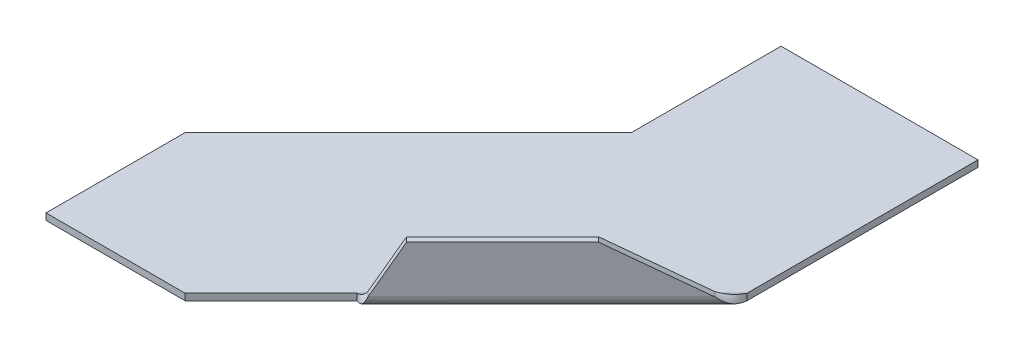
ISO-10303-21;
HEADER;
FILE_DESCRIPTION(('STEP AP214'),'2;1');
FILE_NAME('part.step','',(''),(''),'','','');
FILE_SCHEMA(('AUTOMOTIVE_DESIGN { 1 0 10303 214 1 1 1 1 }'));
ENDSEC;
DATA;
#1=APPLICATION_CONTEXT('core data for automotive mechanical design processes');
#2=APPLICATION_PROTOCOL_DEFINITION('international standard','automotive_design',2000,#1);
#3=PRODUCT_CONTEXT('',#1,'mechanical');
#4=PRODUCT('Part','Part','',(#3));
#5=PRODUCT_RELATED_PRODUCT_CATEGORY('part','',(#4));
#6=PRODUCT_DEFINITION_FORMATION('','',#4);
#7=PRODUCT_DEFINITION_CONTEXT('part definition',#1,'design');
#8=PRODUCT_DEFINITION('design','',#6,#7);
#9=PRODUCT_DEFINITION_SHAPE('','',#8);
#10=(LENGTH_UNIT() NAMED_UNIT(*) SI_UNIT(.MILLI.,.METRE.));
#11=(NAMED_UNIT(*) PLANE_ANGLE_UNIT() SI_UNIT($,.RADIAN.));
#12=(NAMED_UNIT(*) SI_UNIT($,.STERADIAN.) SOLID_ANGLE_UNIT());
#13=UNCERTAINTY_MEASURE_WITH_UNIT(LENGTH_MEASURE(1.E-05),#10,'distance_accuracy_value','');
#14=(GEOMETRIC_REPRESENTATION_CONTEXT(3) GLOBAL_UNCERTAINTY_ASSIGNED_CONTEXT((#13)) GLOBAL_UNIT_ASSIGNED_CONTEXT((#10,
#11,#12)) REPRESENTATION_CONTEXT('',''));
#15=CARTESIAN_POINT('',(0.,0.,0.));
#16=DIRECTION('',(0.,0.,1.));
#17=DIRECTION('',(1.,0.,0.));
#18=AXIS2_PLACEMENT_3D('',#15,#16,#17);
#19=CARTESIAN_POINT('',(94.293250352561,0.,94.29325035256));
#20=DIRECTION('',(-0.707106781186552,0.,-0.707106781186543));
#21=DIRECTION('',(-0.707106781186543,0.,0.707106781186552));
#22=AXIS2_PLACEMENT_3D('',#19,#20,#21);
#23=PLANE('',#22);
#24=DIRECTION('',(-0.707106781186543,0.,0.707106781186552));
#25=VECTOR('',#24,1.);
#26=CARTESIAN_POINT('',(94.2932503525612,40.0000000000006,94.2932503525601));
#27=LINE('',#26,#25);
#28=CARTESIAN_POINT('',(-50.2325178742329,40.0000000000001,238.819018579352));
#29=VERTEX_POINT('',#28);
#30=CARTESIAN_POINT('',(-123.357250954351,39.9999999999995,311.943751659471));
#31=VERTEX_POINT('',#30);
#32=EDGE_CURVE('E624',#29,#31,#27,.T.);
#33=ORIENTED_EDGE('',*,*,#32,.T.);
#34=DIRECTION('',(-0.353553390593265,-0.866025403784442,0.353553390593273));
#35=VECTOR('',#34,1.);
#36=CARTESIAN_POINT('',(-123.357250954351,39.9999999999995,311.943751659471));
#37=LINE('',#36,#35);
#38=CARTESIAN_POINT('',(-138.095014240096,3.90000000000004,326.681514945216));
#39=VERTEX_POINT('',#38);
#40=EDGE_CURVE('E264',#31,#39,#37,.T.);
#41=ORIENTED_EDGE('',*,*,#40,.T.);
#42=DIRECTION('',(-0.707106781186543,0.,0.707106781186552));
#43=VECTOR('',#42,1.);
#44=CARTESIAN_POINT('',(-207.706749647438,3.90000000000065,396.293250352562));
#45=LINE('',#44,#43);
#46=CARTESIAN_POINT('',(-6.01922801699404,3.9,194.605728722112));
#47=VERTEX_POINT('',#46);
#48=EDGE_CURVE('E192',#47,#39,#45,.T.);
#49=ORIENTED_EDGE('',*,*,#48,.F.);
#50=DIRECTION('',(-0.612372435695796,0.49999999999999,0.612372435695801));
#51=VECTOR('',#50,1.);
#52=CARTESIAN_POINT('',(6.29325035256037,-6.15309649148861,182.293250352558));
#53=LINE('',#52,#51);
#54=EDGE_CURVE('E271',#47,#29,#53,.T.);
#55=ORIENTED_EDGE('',*,*,#54,.T.);
#56=EDGE_LOOP('',(#33,#41,#49,#55));
#57=FACE_BOUND('',#56,.T.);
#58=ADVANCED_FACE('F74',(#57),#23,.F.);
#59=CARTESIAN_POINT('',(90.7577164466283,1.11022302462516E-13,90.7577164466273));
#60=DIRECTION('',(-0.707106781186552,0.,-0.707106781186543));
#61=DIRECTION('',(-0.707106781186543,0.,0.707106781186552));
#62=AXIS2_PLACEMENT_3D('',#59,#60,#61);
#63=PLANE('',#62);
#64=DIRECTION('',(-0.353553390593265,-0.866025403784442,0.353553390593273));
#65=VECTOR('',#64,1.);
#66=CARTESIAN_POINT('',(-126.892784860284,39.9999999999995,308.408217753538));
#67=LINE('',#66,#65);
#68=CARTESIAN_POINT('',(-126.892784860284,39.9999999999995,308.408217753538));
#69=VERTEX_POINT('',#68);
#70=CARTESIAN_POINT('',(-141.630548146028,3.89999999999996,323.145981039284));
#71=VERTEX_POINT('',#70);
#72=EDGE_CURVE('E99',#69,#71,#67,.T.);
#73=ORIENTED_EDGE('',*,*,#72,.F.);
#74=DIRECTION('',(0.707106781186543,0.,-0.707106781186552));
#75=VECTOR('',#74,1.);
#76=CARTESIAN_POINT('',(-211.24228355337,40.0000000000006,392.75771644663));
#77=LINE('',#76,#75);
#78=CARTESIAN_POINT('',(-53.7680517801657,40.0000000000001,235.283484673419));
#79=VERTEX_POINT('',#78);
#80=EDGE_CURVE('E622',#79,#69,#77,.F.);
#81=ORIENTED_EDGE('',*,*,#80,.F.);
#82=DIRECTION('',(-0.612372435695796,0.49999999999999,0.612372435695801));
#83=VECTOR('',#82,1.);
#84=CARTESIAN_POINT('',(2.75771644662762,-6.15309649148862,178.757716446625));
#85=LINE('',#84,#83);
#86=CARTESIAN_POINT('',(-9.55476192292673,3.89999999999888,191.07019481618));
#87=VERTEX_POINT('',#86);
#88=EDGE_CURVE('E91',#87,#79,#85,.T.);
#89=ORIENTED_EDGE('',*,*,#88,.F.);
#90=DIRECTION('',(0.707106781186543,0.,-0.707106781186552));
#91=VECTOR('',#90,1.);
#92=CARTESIAN_POINT('',(-211.242283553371,3.90000000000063,392.75771644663));
#93=LINE('',#92,#91);
#94=EDGE_CURVE('E84',#71,#87,#93,.T.);
#95=ORIENTED_EDGE('',*,*,#94,.F.);
#96=EDGE_LOOP('',(#73,#81,#89,#95));
#97=FACE_BOUND('',#96,.T.);
#98=ADVANCED_FACE('F248',(#97),#63,.T.);
#99=CARTESIAN_POINT('',(-207.706749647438,40.0000000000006,396.293250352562));
#100=DIRECTION('',(0.,-1.,0.));
#101=DIRECTION('',(1.,0.,0.));
#102=AXIS2_PLACEMENT_3D('',#99,#100,#101);
#103=PLANE('',#102);
#104=ORIENTED_EDGE('',*,*,#80,.T.);
#105=DIRECTION('',(-0.707106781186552,0.,-0.707106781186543));
#106=VECTOR('',#105,1.);
#107=CARTESIAN_POINT('',(-123.357250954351,39.9999999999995,311.943751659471));
#108=LINE('',#107,#106);
#109=EDGE_CURVE('E274',#31,#69,#108,.T.);
#110=ORIENTED_EDGE('',*,*,#109,.F.);
#111=ORIENTED_EDGE('',*,*,#32,.F.);
#112=DIRECTION('',(-0.707106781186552,0.,-0.707106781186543));
#113=VECTOR('',#112,1.);
#114=CARTESIAN_POINT('',(-50.2325178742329,40.0000000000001,238.819018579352));
#115=LINE('',#114,#113);
#116=EDGE_CURVE('E270',#29,#79,#115,.T.);
#117=ORIENTED_EDGE('',*,*,#116,.T.);
#118=EDGE_LOOP('',(#104,#110,#111,#117));
#119=FACE_BOUND('',#118,.T.);
#120=ADVANCED_FACE('F252',(#119),#103,.F.);
#121=CARTESIAN_POINT('',(6.29325035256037,-6.15309649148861,182.293250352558));
#122=DIRECTION('',(-0.353553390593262,-0.866025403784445,0.353553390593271));
#123=DIRECTION('',(-0.612372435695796,0.49999999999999,0.612372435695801));
#124=AXIS2_PLACEMENT_3D('',#121,#122,#123);
#125=PLANE('',#124);
#126=CARTESIAN_POINT('',(-9.55476192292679,3.9,191.07019481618));
#127=CARTESIAN_POINT('',(-6.01922801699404,3.9,194.605728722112));
#128=B_SPLINE_CURVE_WITH_KNOTS('',1,(#126,#127),.UNSPECIFIED.,.F.,.F.,(2,2),(0.,1.),.UNSPECIFIED.);
#129=EDGE_CURVE('E13',#87,#47,#128,.T.);
#130=ORIENTED_EDGE('',*,*,#129,.F.);
#131=ORIENTED_EDGE('',*,*,#88,.T.);
#132=ORIENTED_EDGE('',*,*,#116,.F.);
#133=ORIENTED_EDGE('',*,*,#54,.F.);
#134=EDGE_LOOP('',(#130,#131,#132,#133));
#135=FACE_BOUND('',#134,.T.);
#136=ADVANCED_FACE('F76',(#135),#125,.F.);
#137=CARTESIAN_POINT('',(-123.357250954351,39.9999999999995,311.943751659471));
#138=DIRECTION('',(0.612372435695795,-0.499999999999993,-0.6123724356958));
#139=DIRECTION('',(-0.353553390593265,-0.866025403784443,0.353553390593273));
#140=AXIS2_PLACEMENT_3D('',#137,#138,#139);
#141=PLANE('',#140);
#142=CARTESIAN_POINT('',(-138.095014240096,3.9,326.681514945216));
#143=CARTESIAN_POINT('',(-141.630548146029,3.9,323.145981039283));
#144=B_SPLINE_CURVE_WITH_KNOTS('',1,(#142,#143),.UNSPECIFIED.,.F.,.F.,(2,2),(0.,1.),.UNSPECIFIED.);
#145=EDGE_CURVE('E300',#39,#71,#144,.T.);
#146=ORIENTED_EDGE('',*,*,#145,.F.);
#147=ORIENTED_EDGE('',*,*,#40,.F.);
#148=ORIENTED_EDGE('',*,*,#109,.T.);
#149=ORIENTED_EDGE('',*,*,#72,.T.);
#150=EDGE_LOOP('',(#146,#147,#148,#149));
#151=FACE_BOUND('',#150,.T.);
#152=ADVANCED_FACE('F255',(#151),#141,.F.);
#153=CARTESIAN_POINT('',(-150.,-5.,0.));
#154=DIRECTION('',(0.,0.,-1.));
#155=DIRECTION('',(-1.,0.,0.));
#156=AXIS2_PLACEMENT_3D('',#153,#154,#155);
#157=PLANE('',#156);
#158=DIRECTION('',(-1.,0.,0.));
#159=VECTOR('',#158,1.);
#160=CARTESIAN_POINT('',(-150.,0.,0.));
#161=LINE('',#160,#159);
#162=CARTESIAN_POINT('',(0.,0.,0.));
#163=VERTEX_POINT('',#162);
#164=CARTESIAN_POINT('',(-150.,0.,0.));
#165=VERTEX_POINT('',#164);
#166=EDGE_CURVE('E327',#163,#165,#161,.T.);
#167=ORIENTED_EDGE('',*,*,#166,.F.);
#168=DIRECTION('',(0.,1.,0.));
#169=VECTOR('',#168,1.);
#170=CARTESIAN_POINT('',(0.,-5.,0.));
#171=LINE('',#170,#169);
#172=CARTESIAN_POINT('',(0.,-5.,0.));
#173=VERTEX_POINT('',#172);
#174=EDGE_CURVE('E222',#173,#163,#171,.T.);
#175=ORIENTED_EDGE('',*,*,#174,.F.);
#176=DIRECTION('',(-1.,0.,0.));
#177=VECTOR('',#176,1.);
#178=CARTESIAN_POINT('',(-150.,-5.,0.));
#179=LINE('',#178,#177);
#180=CARTESIAN_POINT('',(-150.,-5.,0.));
#181=VERTEX_POINT('',#180);
#182=EDGE_CURVE('E214',#173,#181,#179,.T.);
#183=ORIENTED_EDGE('',*,*,#182,.T.);
#184=DIRECTION('',(0.,1.,0.));
#185=VECTOR('',#184,1.);
#186=CARTESIAN_POINT('',(-150.,-5.,0.));
#187=LINE('',#186,#185);
#188=EDGE_CURVE('E348',#181,#165,#187,.T.);
#189=ORIENTED_EDGE('',*,*,#188,.T.);
#190=EDGE_LOOP('',(#167,#175,#183,#189));
#191=FACE_BOUND('',#190,.T.);
#192=ADVANCED_FACE('F258',(#191),#157,.T.);
#193=CARTESIAN_POINT('',(-150.,-5.,113.999999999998));
#194=DIRECTION('',(-1.,0.,0.));
#195=DIRECTION('',(0.,0.,1.));
#196=AXIS2_PLACEMENT_3D('',#193,#194,#195);
#197=PLANE('',#196);
#198=DIRECTION('',(0.,0.,1.));
#199=VECTOR('',#198,1.);
#200=CARTESIAN_POINT('',(-150.,0.,113.999999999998));
#201=LINE('',#200,#199);
#202=CARTESIAN_POINT('',(-150.,0.,113.999999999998));
#203=VERTEX_POINT('',#202);
#204=EDGE_CURVE('E324',#165,#203,#201,.T.);
#205=ORIENTED_EDGE('',*,*,#204,.F.);
#206=ORIENTED_EDGE('',*,*,#188,.F.);
#207=DIRECTION('',(0.,0.,1.));
#208=VECTOR('',#207,1.);
#209=CARTESIAN_POINT('',(-150.,-5.,113.999999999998));
#210=LINE('',#209,#208);
#211=CARTESIAN_POINT('',(-150.,-5.,113.999999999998));
#212=VERTEX_POINT('',#211);
#213=EDGE_CURVE('E345',#181,#212,#210,.T.);
#214=ORIENTED_EDGE('',*,*,#213,.T.);
#215=DIRECTION('',(0.,1.,0.));
#216=VECTOR('',#215,1.);
#217=CARTESIAN_POINT('',(-150.,-5.,113.999999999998));
#218=LINE('',#217,#216);
#219=EDGE_CURVE('E343',#212,#203,#218,.T.);
#220=ORIENTED_EDGE('',*,*,#219,.T.);
#221=EDGE_LOOP('',(#205,#206,#214,#220));
#222=FACE_BOUND('',#221,.T.);
#223=ADVANCED_FACE('F383',(#222),#197,.T.);
#224=CARTESIAN_POINT('',(-150.,-5.,113.999999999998));
#225=DIRECTION('',(-0.707106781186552,0.,-0.707106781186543));
#226=DIRECTION('',(-0.707106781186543,0.,0.707106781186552));
#227=AXIS2_PLACEMENT_3D('',#224,#225,#226);
#228=PLANE('',#227);
#229=DIRECTION('',(-0.707106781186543,0.,0.707106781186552));
#230=VECTOR('',#229,1.);
#231=CARTESIAN_POINT('',(-150.,0.,113.999999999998));
#232=LINE('',#231,#230);
#233=CARTESIAN_POINT('',(-320.,0.,284.));
#234=VERTEX_POINT('',#233);
#235=EDGE_CURVE('E321',#203,#234,#232,.T.);
#236=ORIENTED_EDGE('',*,*,#235,.F.);
#237=ORIENTED_EDGE('',*,*,#219,.F.);
#238=DIRECTION('',(-0.707106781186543,0.,0.707106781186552));
#239=VECTOR('',#238,1.);
#240=CARTESIAN_POINT('',(-150.,-5.,113.999999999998));
#241=LINE('',#240,#239);
#242=CARTESIAN_POINT('',(-320.,-5.,284.));
#243=VERTEX_POINT('',#242);
#244=EDGE_CURVE('E340',#212,#243,#241,.T.);
#245=ORIENTED_EDGE('',*,*,#244,.T.);
#246=DIRECTION('',(0.,1.,0.));
#247=VECTOR('',#246,1.);
#248=CARTESIAN_POINT('',(-320.,-5.,284.));
#249=LINE('',#248,#247);
#250=EDGE_CURVE('E338',#243,#234,#249,.T.);
#251=ORIENTED_EDGE('',*,*,#250,.T.);
#252=EDGE_LOOP('',(#236,#237,#245,#251));
#253=FACE_BOUND('',#252,.T.);
#254=ADVANCED_FACE('F379',(#253),#228,.T.);
#255=CARTESIAN_POINT('',(-320.,-5.,390.));
#256=DIRECTION('',(-1.,0.,0.));
#257=DIRECTION('',(0.,0.,1.));
#258=AXIS2_PLACEMENT_3D('',#255,#256,#257);
#259=PLANE('',#258);
#260=DIRECTION('',(0.,0.,1.));
#261=VECTOR('',#260,1.);
#262=CARTESIAN_POINT('',(-320.,0.,390.));
#263=LINE('',#262,#261);
#264=CARTESIAN_POINT('',(-320.,0.,390.));
#265=VERTEX_POINT('',#264);
#266=EDGE_CURVE('E318',#234,#265,#263,.T.);
#267=ORIENTED_EDGE('',*,*,#266,.F.);
#268=ORIENTED_EDGE('',*,*,#250,.F.);
#269=DIRECTION('',(0.,0.,1.));
#270=VECTOR('',#269,1.);
#271=CARTESIAN_POINT('',(-320.,-5.,390.));
#272=LINE('',#271,#270);
#273=CARTESIAN_POINT('',(-320.,-5.,390.));
#274=VERTEX_POINT('',#273);
#275=EDGE_CURVE('E335',#243,#274,#272,.T.);
#276=ORIENTED_EDGE('',*,*,#275,.T.);
#277=DIRECTION('',(0.,1.,0.));
#278=VECTOR('',#277,1.);
#279=CARTESIAN_POINT('',(-320.,-5.,390.));
#280=LINE('',#279,#278);
#281=EDGE_CURVE('E333',#274,#265,#280,.T.);
#282=ORIENTED_EDGE('',*,*,#281,.T.);
#283=EDGE_LOOP('',(#267,#268,#276,#282));
#284=FACE_BOUND('',#283,.T.);
#285=ADVANCED_FACE('F375',(#284),#259,.T.);
#286=CARTESIAN_POINT('',(-214.,-5.,390.));
#287=DIRECTION('',(0.,0.,1.));
#288=DIRECTION('',(1.,0.,0.));
#289=AXIS2_PLACEMENT_3D('',#286,#287,#288);
#290=PLANE('',#289);
#291=DIRECTION('',(1.,0.,0.));
#292=VECTOR('',#291,1.);
#293=CARTESIAN_POINT('',(-214.,0.,390.));
#294=LINE('',#293,#292);
#295=CARTESIAN_POINT('',(-214.,0.,390.));
#296=VERTEX_POINT('',#295);
#297=EDGE_CURVE('E314',#265,#296,#294,.T.);
#298=ORIENTED_EDGE('',*,*,#297,.F.);
#299=ORIENTED_EDGE('',*,*,#281,.F.);
#300=DIRECTION('',(1.,0.,0.));
#301=VECTOR('',#300,1.);
#302=CARTESIAN_POINT('',(-214.,-5.,390.));
#303=LINE('',#302,#301);
#304=CARTESIAN_POINT('',(-214.,-5.,390.));
#305=VERTEX_POINT('',#304);
#306=EDGE_CURVE('E331',#274,#305,#303,.T.);
#307=ORIENTED_EDGE('',*,*,#306,.T.);
#308=DIRECTION('',(0.,1.,0.));
#309=VECTOR('',#308,1.);
#310=CARTESIAN_POINT('',(-214.,-5.,390.));
#311=LINE('',#310,#309);
#312=EDGE_CURVE('E201',#305,#296,#311,.T.);
#313=ORIENTED_EDGE('',*,*,#312,.T.);
#314=EDGE_LOOP('',(#298,#299,#307,#313));
#315=FACE_BOUND('',#314,.T.);
#316=ADVANCED_FACE('F372',(#315),#290,.T.);
#317=CARTESIAN_POINT('',(0.,-5.,0.));
#318=DIRECTION('',(0.,-1.,0.));
#319=DIRECTION('',(0.,0.,-1.));
#320=AXIS2_PLACEMENT_3D('',#317,#318,#319);
#321=PLANE('',#320);
#322=DIRECTION('',(0.,0.,-1.));
#323=VECTOR('',#322,1.);
#324=CARTESIAN_POINT('',(0.,-5.,175.999999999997));
#325=LINE('',#324,#323);
#326=CARTESIAN_POINT('',(-1.33226762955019E-12,-5.,175.999999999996));
#327=VERTEX_POINT('',#326);
#328=EDGE_CURVE('E210',#327,#173,#325,.T.);
#329=ORIENTED_EDGE('',*,*,#328,.F.);
#330=DIRECTION('',(0.707106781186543,0.,-0.707106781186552));
#331=VECTOR('',#330,1.);
#332=CARTESIAN_POINT('',(0.,-5.,175.999999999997));
#333=LINE('',#332,#331);
#334=CARTESIAN_POINT('',(-148.492424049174,-5.,324.492424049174));
#335=VERTEX_POINT('',#334);
#336=EDGE_CURVE('E190',#335,#327,#333,.T.);
#337=ORIENTED_EDGE('',*,*,#336,.F.);
#338=DIRECTION('',(0.707106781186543,0.,-0.707106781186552));
#339=VECTOR('',#338,1.);
#340=CARTESIAN_POINT('',(0.,-5.,175.999999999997));
#341=LINE('',#340,#339);
#342=EDGE_CURVE('E182',#305,#335,#341,.T.);
#343=ORIENTED_EDGE('',*,*,#342,.F.);
#344=ORIENTED_EDGE('',*,*,#306,.F.);
#345=ORIENTED_EDGE('',*,*,#275,.F.);
#346=ORIENTED_EDGE('',*,*,#244,.F.);
#347=ORIENTED_EDGE('',*,*,#213,.F.);
#348=ORIENTED_EDGE('',*,*,#182,.F.);
#349=EDGE_LOOP('',(#329,#337,#343,#344,#345,#346,#347,#348));
#350=FACE_BOUND('',#349,.T.);
#351=ADVANCED_FACE('F207',(#350),#321,.T.);
#352=CARTESIAN_POINT('',(-148.492424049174,-5.,324.492424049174));
#353=DIRECTION('',(-0.707106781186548,0.,-0.707106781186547));
#354=DIRECTION('',(-0.707106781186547,0.,0.707106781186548));
#355=AXIS2_PLACEMENT_3D('',#352,#353,#354);
#356=PLANE('',#355);
#357=DIRECTION('',(0.707106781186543,0.,-0.707106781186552));
#358=VECTOR('',#357,1.);
#359=CARTESIAN_POINT('',(0.,0.,175.999999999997));
#360=LINE('',#359,#358);
#361=CARTESIAN_POINT('',(-148.492424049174,0.,324.492424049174));
#362=VERTEX_POINT('',#361);
#363=EDGE_CURVE('E317',#296,#362,#360,.T.);
#364=ORIENTED_EDGE('',*,*,#363,.F.);
#365=ORIENTED_EDGE('',*,*,#312,.F.);
#366=ORIENTED_EDGE('',*,*,#342,.T.);
#367=CARTESIAN_POINT('',(-148.492424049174,0.,324.492424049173));
#368=CARTESIAN_POINT('',(-148.492424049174,-5.,324.492424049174));
#369=B_SPLINE_CURVE_WITH_KNOTS('',1,(#367,#368),.UNSPECIFIED.,.F.,.F.,(2,2),(0.,1.),.UNSPECIFIED.);
#370=EDGE_CURVE('E166',#335,#362,#369,.F.);
#371=ORIENTED_EDGE('',*,*,#370,.T.);
#372=EDGE_LOOP('',(#364,#365,#366,#371));
#373=FACE_BOUND('',#372,.T.);
#374=ADVANCED_FACE('F199',(#373),#356,.F.);
#375=CARTESIAN_POINT('',(0.,0.,0.));
#376=DIRECTION('',(0.,-1.,0.));
#377=DIRECTION('',(0.,0.,-1.));
#378=AXIS2_PLACEMENT_3D('',#375,#376,#377);
#379=PLANE('',#378);
#380=DIRECTION('',(0.,0.,-1.));
#381=VECTOR('',#380,1.);
#382=CARTESIAN_POINT('',(0.,0.,175.999999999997));
#383=LINE('',#382,#381);
#384=CARTESIAN_POINT('',(-6.16099287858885E-13,0.,175.999999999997));
#385=VERTEX_POINT('',#384);
#386=EDGE_CURVE('E181',#385,#163,#383,.T.);
#387=ORIENTED_EDGE('',*,*,#386,.T.);
#388=ORIENTED_EDGE('',*,*,#166,.T.);
#389=ORIENTED_EDGE('',*,*,#204,.T.);
#390=ORIENTED_EDGE('',*,*,#235,.T.);
#391=ORIENTED_EDGE('',*,*,#266,.T.);
#392=ORIENTED_EDGE('',*,*,#297,.T.);
#393=ORIENTED_EDGE('',*,*,#363,.T.);
#394=DIRECTION('',(0.707106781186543,0.,-0.707106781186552));
#395=VECTOR('',#394,1.);
#396=CARTESIAN_POINT('',(0.,0.,175.999999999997));
#397=LINE('',#396,#395);
#398=EDGE_CURVE('E223',#362,#385,#397,.T.);
#399=ORIENTED_EDGE('',*,*,#398,.T.);
#400=EDGE_LOOP('',(#387,#388,#389,#390,#391,#392,#393,#399));
#401=FACE_BOUND('',#400,.T.);
#402=ADVANCED_FACE('F244',(#401),#379,.F.);
#403=CARTESIAN_POINT('',(0.,-5.,175.999999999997));
#404=DIRECTION('',(1.,0.,0.));
#405=DIRECTION('',(0.,0.,-1.));
#406=AXIS2_PLACEMENT_3D('',#403,#404,#405);
#407=PLANE('',#406);
#408=ORIENTED_EDGE('',*,*,#386,.F.);
#409=CARTESIAN_POINT('',(-1.31431126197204E-12,-5.,175.999999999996));
#410=CARTESIAN_POINT('',(-6.04828851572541E-13,0.,175.999999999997));
#411=B_SPLINE_CURVE_WITH_KNOTS('',1,(#409,#410),.UNSPECIFIED.,.F.,.F.,(2,2),(0.,1.),.UNSPECIFIED.);
#412=EDGE_CURVE('E212',#327,#385,#411,.T.);
#413=ORIENTED_EDGE('',*,*,#412,.F.);
#414=ORIENTED_EDGE('',*,*,#328,.T.);
#415=ORIENTED_EDGE('',*,*,#174,.T.);
#416=EDGE_LOOP('',(#408,#413,#414,#415));
#417=FACE_BOUND('',#416,.T.);
#418=ADVANCED_FACE('F234',(#417),#407,.T.);
#419=CARTESIAN_POINT('',(-138.095014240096,3.9,326.681514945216));
#420=CARTESIAN_POINT('',(-138.437080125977,2.73481355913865,327.023580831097));
#421=CARTESIAN_POINT('',(-138.942837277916,1.57044382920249,327.201745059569));
#422=CARTESIAN_POINT('',(-140.257361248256,-0.582208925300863,327.255274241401));
#423=CARTESIAN_POINT('',(-141.065827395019,-1.56946580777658,327.130834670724));
#424=CARTESIAN_POINT('',(-142.914861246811,-3.21703489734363,326.649853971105));
#425=CARTESIAN_POINT('',(-143.954970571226,-3.87669885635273,326.293771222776));
#426=CARTESIAN_POINT('',(-146.161152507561,-4.7683568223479,325.455642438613));
#427=CARTESIAN_POINT('',(-147.326446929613,-4.99999999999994,324.974269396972));
#428=CARTESIAN_POINT('',(-148.492424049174,-5.,324.492424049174));
#429=CARTESIAN_POINT('',(-141.630548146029,3.9,323.145981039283));
#430=CARTESIAN_POINT('',(-141.972593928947,3.38944269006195,323.488026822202));
#431=CARTESIAN_POINT('',(-142.386350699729,2.87918325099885,323.758231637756));
#432=CARTESIAN_POINT('',(-143.346662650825,1.93588597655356,324.165972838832));
#433=CARTESIAN_POINT('',(-143.893076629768,1.50326779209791,324.303585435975));
#434=CARTESIAN_POINT('',(-145.087612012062,0.781299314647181,324.477103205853));
#435=CARTESIAN_POINT('',(-145.735532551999,0.492233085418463,324.513209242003));
#436=CARTESIAN_POINT('',(-147.08657102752,0.101506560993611,324.530223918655));
#437=CARTESIAN_POINT('',(-147.789359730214,0.,324.511396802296));
#438=CARTESIAN_POINT('',(-148.492424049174,0.,324.492424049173));
#439=B_SPLINE_SURFACE_WITH_KNOTS('',1,3,((#419,#420,#421,#422,#423,#424,#425,#426,#427,#428),
(#429,#430,#431,#432,#433,#434,#435,#436,#437,#438)),.UNSPECIFIED.,.F.,.F.,.F.,(2,2),(4,2,2,2,
4),(0.,1.),(0.,0.25,0.5,0.75,1.),.UNSPECIFIED.);
#440=CARTESIAN_POINT('',(-141.630548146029,3.9,323.145981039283));
#441=CARTESIAN_POINT('',(-141.972593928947,3.38944269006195,323.488026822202));
#442=CARTESIAN_POINT('',(-142.386350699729,2.87918325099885,323.758231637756));
#443=CARTESIAN_POINT('',(-143.346662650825,1.93588597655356,324.165972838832));
#444=CARTESIAN_POINT('',(-143.893076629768,1.50326779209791,324.303585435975));
#445=CARTESIAN_POINT('',(-145.087612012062,0.781299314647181,324.477103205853));
#446=CARTESIAN_POINT('',(-145.735532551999,0.492233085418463,324.513209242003));
#447=CARTESIAN_POINT('',(-147.08657102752,0.101506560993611,324.530223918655));
#448=CARTESIAN_POINT('',(-147.789359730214,0.,324.511396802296));
#449=CARTESIAN_POINT('',(-148.492424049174,0.,324.492424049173));
#450=B_SPLINE_CURVE_WITH_KNOTS('',3,(#440,#441,#442,#443,#444,#445,#446,#447,#448,#449),
.UNSPECIFIED.,.F.,.F.,(4,2,2,2,4),(0.,0.25,0.5,0.75,1.),.UNSPECIFIED.);
#451=EDGE_CURVE('E175',#71,#362,#450,.T.);
#452=CARTESIAN_POINT('',(-148.492424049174,-5.,324.492424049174));
#453=CARTESIAN_POINT('',(-147.326446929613,-4.99999999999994,324.974269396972));
#454=CARTESIAN_POINT('',(-146.161152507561,-4.7683568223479,325.455642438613));
#455=CARTESIAN_POINT('',(-143.954970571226,-3.87669885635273,326.293771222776));
#456=CARTESIAN_POINT('',(-142.914861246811,-3.21703489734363,326.649853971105));
#457=CARTESIAN_POINT('',(-141.065827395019,-1.56946580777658,327.130834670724));
#458=CARTESIAN_POINT('',(-140.257361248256,-0.582208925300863,327.255274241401));
#459=CARTESIAN_POINT('',(-138.942837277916,1.57044382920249,327.201745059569));
#460=CARTESIAN_POINT('',(-138.437080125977,2.73481355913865,327.023580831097));
#461=CARTESIAN_POINT('',(-138.095014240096,3.9,326.681514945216));
#462=B_SPLINE_CURVE_WITH_KNOTS('',3,(#452,#453,#454,#455,#456,#457,#458,#459,#460,#461),
.UNSPECIFIED.,.F.,.F.,(4,2,2,2,4),(0.,0.25,0.5,0.75,1.),.UNSPECIFIED.);
#463=EDGE_CURVE('E171',#39,#335,#462,.F.);
#464=ORIENTED_EDGE('',*,*,#145,.T.);
#465=ORIENTED_EDGE('',*,*,#451,.T.);
#466=ORIENTED_EDGE('',*,*,#370,.F.);
#467=ORIENTED_EDGE('',*,*,#463,.F.);
#468=EDGE_LOOP('',(#464,#465,#466,#467));
#469=FACE_BOUND('',#468,.T.);
#470=ADVANCED_FACE('F170',(#469),#439,.T.);
#471=CARTESIAN_POINT('',(-1.31431126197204E-12,-5.,175.999999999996));
#472=CARTESIAN_POINT('',(-0.202269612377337,-5.00000000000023,177.849955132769));
#473=CARTESIAN_POINT('',(-0.404834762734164,-4.76835682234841,179.699324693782));
#474=CARTESIAN_POINT('',(-0.934759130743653,-3.87669885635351,183.27355978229));
#475=CARTESIAN_POINT('',(-1.26270295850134,-3.21703489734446,184.997695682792));
#476=CARTESIAN_POINT('',(-2.1497754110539,-1.56946580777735,188.214782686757));
#477=CARTESIAN_POINT('',(-2.70936241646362,-0.582208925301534,189.707275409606));
#478=CARTESIAN_POINT('',(-4.13094475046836,1.57044382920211,192.38985253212));
#479=CARTESIAN_POINT('',(-4.99311564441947,2.73491039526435,193.579616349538));
#480=CARTESIAN_POINT('',(-6.01922801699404,3.9,194.605728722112));
#481=CARTESIAN_POINT('',(-6.04828851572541E-13,0.,175.999999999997));
#482=CARTESIAN_POINT('',(-0.665068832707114,-1.03312280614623E-13,177.387051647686));
#483=CARTESIAN_POINT('',(-1.33025328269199,0.101506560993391,178.773906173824));
#484=CARTESIAN_POINT('',(-2.71532111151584,0.492233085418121,181.492997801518));
#485=CARTESIAN_POINT('',(-3.43545372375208,0.781299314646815,182.824944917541));
#486=CARTESIAN_POINT('',(-4.97702464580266,1.50326779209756,185.387533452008));
#487=CARTESIAN_POINT('',(-5.7986638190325,1.93588597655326,186.617974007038));
#488=CARTESIAN_POINT('',(-7.57445817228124,2.87918325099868,188.946339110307));
#489=CARTESIAN_POINT('',(-8.5287016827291,3.38948105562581,190.044134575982));
#490=CARTESIAN_POINT('',(-9.55476192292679,3.9,191.07019481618));
#491=B_SPLINE_SURFACE_WITH_KNOTS('',1,3,((#471,#472,#473,#474,#475,#476,#477,#478,#479,#480),
(#481,#482,#483,#484,#485,#486,#487,#488,#489,#490)),.UNSPECIFIED.,.F.,.F.,.F.,(2,2),(4,2,2,2,
4),(0.,1.),(0.,0.25,0.5,0.75,1.),.UNSPECIFIED.);
#492=CARTESIAN_POINT('',(-6.04828851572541E-13,0.,175.999999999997));
#493=CARTESIAN_POINT('',(-0.665068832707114,-1.03312280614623E-13,177.387051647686));
#494=CARTESIAN_POINT('',(-1.33025328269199,0.101506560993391,178.773906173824));
#495=CARTESIAN_POINT('',(-2.71532111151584,0.492233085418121,181.492997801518));
#496=CARTESIAN_POINT('',(-3.43545372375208,0.781299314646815,182.824944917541));
#497=CARTESIAN_POINT('',(-4.97702464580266,1.50326779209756,185.387533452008));
#498=CARTESIAN_POINT('',(-5.7986638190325,1.93588597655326,186.617974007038));
#499=CARTESIAN_POINT('',(-7.57445817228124,2.87918325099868,188.946339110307));
#500=CARTESIAN_POINT('',(-8.5287016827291,3.38948105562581,190.044134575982));
#501=CARTESIAN_POINT('',(-9.55476192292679,3.9,191.07019481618));
#502=B_SPLINE_CURVE_WITH_KNOTS('',3,(#492,#493,#494,#495,#496,#497,#498,#499,#500,#501),
.UNSPECIFIED.,.F.,.F.,(4,2,2,2,4),(0.,0.25,0.5,0.75,1.),.UNSPECIFIED.);
#503=EDGE_CURVE('E195',#385,#87,#502,.T.);
#504=CARTESIAN_POINT('',(-6.01922801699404,3.9,194.605728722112));
#505=CARTESIAN_POINT('',(-4.99311564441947,2.73491039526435,193.579616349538));
#506=CARTESIAN_POINT('',(-4.13094475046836,1.57044382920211,192.38985253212));
#507=CARTESIAN_POINT('',(-2.70936241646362,-0.582208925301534,189.707275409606));
#508=CARTESIAN_POINT('',(-2.1497754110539,-1.56946580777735,188.214782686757));
#509=CARTESIAN_POINT('',(-1.26270295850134,-3.21703489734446,184.997695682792));
#510=CARTESIAN_POINT('',(-0.934759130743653,-3.87669885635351,183.27355978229));
#511=CARTESIAN_POINT('',(-0.404834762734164,-4.76835682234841,179.699324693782));
#512=CARTESIAN_POINT('',(-0.202269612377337,-5.00000000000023,177.849955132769));
#513=CARTESIAN_POINT('',(-1.31431126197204E-12,-5.,175.999999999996));
#514=B_SPLINE_CURVE_WITH_KNOTS('',3,(#504,#505,#506,#507,#508,#509,#510,#511,#512,#513),
.UNSPECIFIED.,.F.,.F.,(4,2,2,2,4),(0.,0.25,0.5,0.75,1.),.UNSPECIFIED.);
#515=EDGE_CURVE('E194',#327,#47,#514,.F.);
#516=ORIENTED_EDGE('',*,*,#412,.T.);
#517=ORIENTED_EDGE('',*,*,#503,.T.);
#518=ORIENTED_EDGE('',*,*,#129,.T.);
#519=ORIENTED_EDGE('',*,*,#515,.F.);
#520=EDGE_LOOP('',(#516,#517,#518,#519));
#521=FACE_BOUND('',#520,.T.);
#522=ADVANCED_FACE('F395',(#521),#491,.T.);
#523=CARTESIAN_POINT('',(75.7976212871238,3.9,100.202378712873));
#524=DIRECTION('',(-0.707106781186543,0.,0.707106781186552));
#525=DIRECTION('',(0.707106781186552,0.,0.707106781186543));
#526=AXIS2_PLACEMENT_3D('',#523,#524,#525);
#527=CYLINDRICAL_SURFACE('',#526,8.9);
#528=ORIENTED_EDGE('',*,*,#515,.T.);
#529=ORIENTED_EDGE('',*,*,#48,.T.);
#530=ORIENTED_EDGE('',*,*,#463,.T.);
#531=ORIENTED_EDGE('',*,*,#336,.T.);
#532=EDGE_LOOP('',(#528,#529,#530,#531));
#533=FACE_BOUND('',#532,.T.);
#534=ADVANCED_FACE('F188',(#533),#527,.T.);
#535=CARTESIAN_POINT('',(75.7976212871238,3.9,100.202378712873));
#536=DIRECTION('',(-0.707106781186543,0.,0.707106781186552));
#537=DIRECTION('',(0.707106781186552,0.,0.707106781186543));
#538=AXIS2_PLACEMENT_3D('',#535,#536,#537);
#539=CYLINDRICAL_SURFACE('',#538,3.9);
#540=ORIENTED_EDGE('',*,*,#503,.F.);
#541=ORIENTED_EDGE('',*,*,#398,.F.);
#542=ORIENTED_EDGE('',*,*,#451,.F.);
#543=ORIENTED_EDGE('',*,*,#94,.T.);
#544=EDGE_LOOP('',(#540,#541,#542,#543));
#545=FACE_BOUND('',#544,.T.);
#546=ADVANCED_FACE('F446',(#545),#539,.F.);
#547=CLOSED_SHELL('',(#58,#98,#120,#136,#152,#192,#223,#254,#285,#316,#351,#374,#402,#418,#470,
#522,#534,#546));
#548=MANIFOLD_SOLID_BREP('B2',#547);
#549=ADVANCED_BREP_SHAPE_REPRESENTATION('',(#18,#548),#14);
#550=SHAPE_DEFINITION_REPRESENTATION(#9,#549);
ENDSEC;
END-ISO-10303-21;
